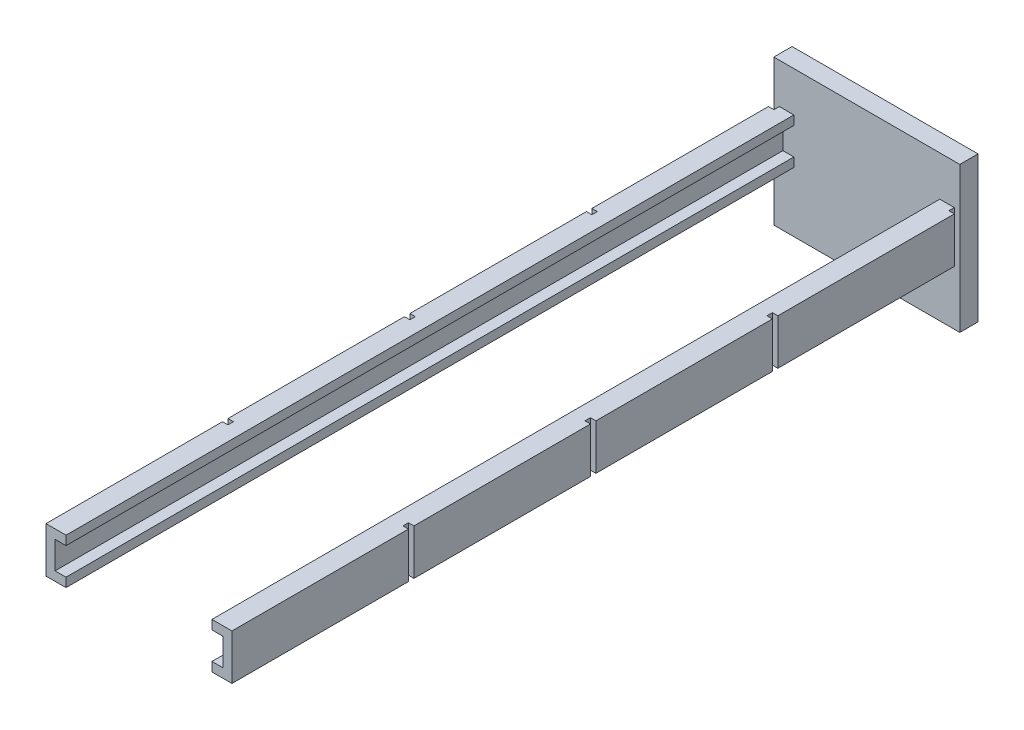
ISO-10303-21;
HEADER;
FILE_DESCRIPTION(('STEP AP214'),'2;1');
FILE_NAME('part.step','',(''),(''),'','','');
FILE_SCHEMA(('AUTOMOTIVE_DESIGN { 1 0 10303 214 1 1 1 1 }'));
ENDSEC;
DATA;
#1=APPLICATION_CONTEXT('core data for automotive mechanical design processes');
#2=APPLICATION_PROTOCOL_DEFINITION('international standard','automotive_design',2000,#1);
#3=PRODUCT_CONTEXT('',#1,'mechanical');
#4=PRODUCT('Part','Part','',(#3));
#5=PRODUCT_RELATED_PRODUCT_CATEGORY('part','',(#4));
#6=PRODUCT_DEFINITION_FORMATION('','',#4);
#7=PRODUCT_DEFINITION_CONTEXT('part definition',#1,'design');
#8=PRODUCT_DEFINITION('design','',#6,#7);
#9=PRODUCT_DEFINITION_SHAPE('','',#8);
#10=(LENGTH_UNIT() NAMED_UNIT(*) SI_UNIT(.MILLI.,.METRE.));
#11=(NAMED_UNIT(*) PLANE_ANGLE_UNIT() SI_UNIT($,.RADIAN.));
#12=(NAMED_UNIT(*) SI_UNIT($,.STERADIAN.) SOLID_ANGLE_UNIT());
#13=UNCERTAINTY_MEASURE_WITH_UNIT(LENGTH_MEASURE(1.E-05),#10,'distance_accuracy_value','');
#14=(GEOMETRIC_REPRESENTATION_CONTEXT(3) GLOBAL_UNCERTAINTY_ASSIGNED_CONTEXT((#13)) GLOBAL_UNIT_ASSIGNED_CONTEXT((#10,
#11,#12)) REPRESENTATION_CONTEXT('',''));
#15=CARTESIAN_POINT('',(0.,0.,0.));
#16=DIRECTION('',(0.,0.,1.));
#17=DIRECTION('',(1.,0.,0.));
#18=AXIS2_PLACEMENT_3D('',#15,#16,#17);
#19=CARTESIAN_POINT('',(-40.1,12.5,400.));
#20=DIRECTION('',(0.,-1.,0.));
#21=DIRECTION('',(1.,0.,0.));
#22=AXIS2_PLACEMENT_3D('',#19,#20,#21);
#23=PLANE('',#22);
#24=DIRECTION('',(-1.,0.,0.));
#25=VECTOR('',#24,1.);
#26=CARTESIAN_POINT('',(-48.1,12.5,300.));
#27=LINE('',#26,#25);
#28=CARTESIAN_POINT('',(-48.1,12.5,300.));
#29=VERTEX_POINT('',#28);
#30=CARTESIAN_POINT('',(-51.1,12.5,300.));
#31=VERTEX_POINT('',#30);
#32=EDGE_CURVE('E365',#29,#31,#27,.T.);
#33=ORIENTED_EDGE('',*,*,#32,.F.);
#34=DIRECTION('',(0.,0.,1.));
#35=VECTOR('',#34,1.);
#36=CARTESIAN_POINT('',(-48.1,12.5,300.));
#37=LINE('',#36,#35);
#38=CARTESIAN_POINT('',(-48.1,12.5,302.991250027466));
#39=VERTEX_POINT('',#38);
#40=EDGE_CURVE('E350',#29,#39,#37,.T.);
#41=ORIENTED_EDGE('',*,*,#40,.T.);
#42=DIRECTION('',(-1.,0.,0.));
#43=VECTOR('',#42,1.);
#44=CARTESIAN_POINT('',(-48.1,12.5,302.991250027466));
#45=LINE('',#44,#43);
#46=CARTESIAN_POINT('',(-51.1,12.5,302.991250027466));
#47=VERTEX_POINT('',#46);
#48=EDGE_CURVE('E348',#39,#47,#45,.T.);
#49=ORIENTED_EDGE('',*,*,#48,.T.);
#50=DIRECTION('',(0.,0.,-1.));
#51=VECTOR('',#50,1.);
#52=CARTESIAN_POINT('',(-51.1,12.5,400.));
#53=LINE('',#52,#51);
#54=CARTESIAN_POINT('',(-51.1,12.5,400.));
#55=VERTEX_POINT('',#54);
#56=EDGE_CURVE('E43',#55,#47,#53,.T.);
#57=ORIENTED_EDGE('',*,*,#56,.F.);
#58=DIRECTION('',(-1.,0.,0.));
#59=VECTOR('',#58,1.);
#60=CARTESIAN_POINT('',(-40.1,12.5,400.));
#61=LINE('',#60,#59);
#62=CARTESIAN_POINT('',(-40.1,12.5,400.));
#63=VERTEX_POINT('',#62);
#64=EDGE_CURVE('E629',#63,#55,#61,.T.);
#65=ORIENTED_EDGE('',*,*,#64,.F.);
#66=DIRECTION('',(0.,0.,-1.));
#67=VECTOR('',#66,1.);
#68=CARTESIAN_POINT('',(-40.1,12.5,400.));
#69=LINE('',#68,#67);
#70=CARTESIAN_POINT('',(-40.1,12.5,0.));
#71=VERTEX_POINT('',#70);
#72=EDGE_CURVE('E11',#63,#71,#69,.T.);
#73=ORIENTED_EDGE('',*,*,#72,.T.);
#74=DIRECTION('',(-1.,0.,0.));
#75=VECTOR('',#74,1.);
#76=CARTESIAN_POINT('',(-40.1,12.5,0.));
#77=LINE('',#76,#75);
#78=CARTESIAN_POINT('',(-48.1,12.5,0.));
#79=VERTEX_POINT('',#78);
#80=EDGE_CURVE('E648',#71,#79,#77,.T.);
#81=ORIENTED_EDGE('',*,*,#80,.T.);
#82=DIRECTION('',(0.,0.,1.));
#83=VECTOR('',#82,1.);
#84=CARTESIAN_POINT('',(-48.1,12.5,0.));
#85=LINE('',#84,#83);
#86=CARTESIAN_POINT('',(-48.1,12.5,2.99125002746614));
#87=VERTEX_POINT('',#86);
#88=EDGE_CURVE('E433',#79,#87,#85,.T.);
#89=ORIENTED_EDGE('',*,*,#88,.T.);
#90=DIRECTION('',(-1.,0.,0.));
#91=VECTOR('',#90,1.);
#92=CARTESIAN_POINT('',(-48.1,12.5,2.99125002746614));
#93=LINE('',#92,#91);
#94=CARTESIAN_POINT('',(-51.1,12.5,2.99125002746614));
#95=VERTEX_POINT('',#94);
#96=EDGE_CURVE('E439',#87,#95,#93,.T.);
#97=ORIENTED_EDGE('',*,*,#96,.T.);
#98=CARTESIAN_POINT('',(-51.1,12.5,100.));
#99=VERTEX_POINT('',#98);
#100=EDGE_CURVE('E667',#99,#95,#53,.T.);
#101=ORIENTED_EDGE('',*,*,#100,.F.);
#102=DIRECTION('',(-1.,0.,0.));
#103=VECTOR('',#102,1.);
#104=CARTESIAN_POINT('',(-48.1,12.5,100.));
#105=LINE('',#104,#103);
#106=CARTESIAN_POINT('',(-48.1,12.5,100.));
#107=VERTEX_POINT('',#106);
#108=EDGE_CURVE('E414',#107,#99,#105,.T.);
#109=ORIENTED_EDGE('',*,*,#108,.F.);
#110=DIRECTION('',(0.,0.,1.));
#111=VECTOR('',#110,1.);
#112=CARTESIAN_POINT('',(-48.1,12.5,100.));
#113=LINE('',#112,#111);
#114=CARTESIAN_POINT('',(-48.1,12.5,102.991250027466));
#115=VERTEX_POINT('',#114);
#116=EDGE_CURVE('E406',#107,#115,#113,.T.);
#117=ORIENTED_EDGE('',*,*,#116,.T.);
#118=DIRECTION('',(-1.,0.,0.));
#119=VECTOR('',#118,1.);
#120=CARTESIAN_POINT('',(-48.1,12.5,102.991250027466));
#121=LINE('',#120,#119);
#122=CARTESIAN_POINT('',(-51.1,12.5,102.991250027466));
#123=VERTEX_POINT('',#122);
#124=EDGE_CURVE('E417',#115,#123,#121,.T.);
#125=ORIENTED_EDGE('',*,*,#124,.T.);
#126=CARTESIAN_POINT('',(-51.1,12.5,200.));
#127=VERTEX_POINT('',#126);
#128=EDGE_CURVE('E671',#127,#123,#53,.T.);
#129=ORIENTED_EDGE('',*,*,#128,.F.);
#130=DIRECTION('',(-1.,0.,0.));
#131=VECTOR('',#130,1.);
#132=CARTESIAN_POINT('',(-48.1,12.5,200.));
#133=LINE('',#132,#131);
#134=CARTESIAN_POINT('',(-48.1,12.5,200.));
#135=VERTEX_POINT('',#134);
#136=EDGE_CURVE('E386',#135,#127,#133,.T.);
#137=ORIENTED_EDGE('',*,*,#136,.F.);
#138=DIRECTION('',(0.,0.,1.));
#139=VECTOR('',#138,1.);
#140=CARTESIAN_POINT('',(-48.1,12.5,200.));
#141=LINE('',#140,#139);
#142=CARTESIAN_POINT('',(-48.1,12.5,202.991250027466));
#143=VERTEX_POINT('',#142);
#144=EDGE_CURVE('E377',#135,#143,#141,.T.);
#145=ORIENTED_EDGE('',*,*,#144,.T.);
#146=DIRECTION('',(-1.,0.,0.));
#147=VECTOR('',#146,1.);
#148=CARTESIAN_POINT('',(-48.1,12.5,202.991250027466));
#149=LINE('',#148,#147);
#150=CARTESIAN_POINT('',(-51.1,12.5,202.991250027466));
#151=VERTEX_POINT('',#150);
#152=EDGE_CURVE('E389',#143,#151,#149,.T.);
#153=ORIENTED_EDGE('',*,*,#152,.T.);
#154=EDGE_CURVE('E37',#31,#151,#53,.T.);
#155=ORIENTED_EDGE('',*,*,#154,.F.);
#156=EDGE_LOOP('',(#33,#41,#49,#57,#65,#73,#81,#89,#97,#101,#109,#117,#125,#129,#137,#145,#153,#155));
#157=FACE_BOUND('',#156,.T.);
#158=ADVANCED_FACE('F33',(#157),#23,.F.);
#159=CARTESIAN_POINT('',(-51.1,12.5,400.));
#160=DIRECTION('',(1.,0.,0.));
#161=DIRECTION('',(0.,0.,-1.));
#162=AXIS2_PLACEMENT_3D('',#159,#160,#161);
#163=PLANE('',#162);
#164=DIRECTION('',(0.,1.,0.));
#165=VECTOR('',#164,1.);
#166=CARTESIAN_POINT('',(-51.1,-12.5,300.));
#167=LINE('',#166,#165);
#168=CARTESIAN_POINT('',(-51.1,-12.5,300.));
#169=VERTEX_POINT('',#168);
#170=EDGE_CURVE('E767',#169,#31,#167,.T.);
#171=ORIENTED_EDGE('',*,*,#170,.T.);
#172=ORIENTED_EDGE('',*,*,#154,.T.);
#173=DIRECTION('',(0.,-1.,0.));
#174=VECTOR('',#173,1.);
#175=CARTESIAN_POINT('',(-51.1,-12.5,202.991250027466));
#176=LINE('',#175,#174);
#177=CARTESIAN_POINT('',(-51.1,-12.5,202.991250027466));
#178=VERTEX_POINT('',#177);
#179=EDGE_CURVE('E372',#151,#178,#176,.T.);
#180=ORIENTED_EDGE('',*,*,#179,.T.);
#181=DIRECTION('',(0.,0.,-1.));
#182=VECTOR('',#181,1.);
#183=CARTESIAN_POINT('',(-51.1,-12.5,400.));
#184=LINE('',#183,#182);
#185=EDGE_CURVE('E674',#169,#178,#184,.T.);
#186=ORIENTED_EDGE('',*,*,#185,.F.);
#187=EDGE_LOOP('',(#171,#172,#180,#186));
#188=FACE_BOUND('',#187,.T.);
#189=ADVANCED_FACE('F739',(#188),#163,.F.);
#190=DIRECTION('',(0.,-1.,0.));
#191=VECTOR('',#190,1.);
#192=CARTESIAN_POINT('',(-51.1,-12.5,302.991250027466));
#193=LINE('',#192,#191);
#194=CARTESIAN_POINT('',(-51.1,-12.5,302.991250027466));
#195=VERTEX_POINT('',#194);
#196=EDGE_CURVE('E764',#47,#195,#193,.T.);
#197=ORIENTED_EDGE('',*,*,#196,.T.);
#198=CARTESIAN_POINT('',(-51.1,-12.5,400.));
#199=VERTEX_POINT('',#198);
#200=EDGE_CURVE('E362',#199,#195,#184,.T.);
#201=ORIENTED_EDGE('',*,*,#200,.F.);
#202=DIRECTION('',(0.,-1.,0.));
#203=VECTOR('',#202,1.);
#204=CARTESIAN_POINT('',(-51.1,12.5,400.));
#205=LINE('',#204,#203);
#206=EDGE_CURVE('E632',#55,#199,#205,.T.);
#207=ORIENTED_EDGE('',*,*,#206,.F.);
#208=ORIENTED_EDGE('',*,*,#56,.T.);
#209=EDGE_LOOP('',(#197,#201,#207,#208));
#210=FACE_BOUND('',#209,.T.);
#211=ADVANCED_FACE('F744',(#210),#163,.F.);
#212=CARTESIAN_POINT('',(-40.1,-12.5,400.));
#213=DIRECTION('',(0.,1.,0.));
#214=DIRECTION('',(-1.,0.,0.));
#215=AXIS2_PLACEMENT_3D('',#212,#213,#214);
#216=PLANE('',#215);
#217=DIRECTION('',(-1.,0.,0.));
#218=VECTOR('',#217,1.);
#219=CARTESIAN_POINT('',(-48.1,-12.5,300.));
#220=LINE('',#219,#218);
#221=CARTESIAN_POINT('',(-48.1,-12.5,300.));
#222=VERTEX_POINT('',#221);
#223=EDGE_CURVE('E363',#222,#169,#220,.T.);
#224=ORIENTED_EDGE('',*,*,#223,.T.);
#225=ORIENTED_EDGE('',*,*,#185,.T.);
#226=DIRECTION('',(-1.,0.,0.));
#227=VECTOR('',#226,1.);
#228=CARTESIAN_POINT('',(-48.1,-12.5,202.991250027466));
#229=LINE('',#228,#227);
#230=CARTESIAN_POINT('',(-48.1,-12.5,202.991250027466));
#231=VERTEX_POINT('',#230);
#232=EDGE_CURVE('E392',#231,#178,#229,.T.);
#233=ORIENTED_EDGE('',*,*,#232,.F.);
#234=DIRECTION('',(0.,0.,-1.));
#235=VECTOR('',#234,1.);
#236=CARTESIAN_POINT('',(-48.1,-12.5,200.));
#237=LINE('',#236,#235);
#238=CARTESIAN_POINT('',(-48.1,-12.5,200.));
#239=VERTEX_POINT('',#238);
#240=EDGE_CURVE('E371',#231,#239,#237,.T.);
#241=ORIENTED_EDGE('',*,*,#240,.T.);
#242=DIRECTION('',(-1.,0.,0.));
#243=VECTOR('',#242,1.);
#244=CARTESIAN_POINT('',(-48.1,-12.5,200.));
#245=LINE('',#244,#243);
#246=CARTESIAN_POINT('',(-51.1,-12.5,200.));
#247=VERTEX_POINT('',#246);
#248=EDGE_CURVE('E380',#239,#247,#245,.T.);
#249=ORIENTED_EDGE('',*,*,#248,.T.);
#250=CARTESIAN_POINT('',(-51.1,-12.5,102.991250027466));
#251=VERTEX_POINT('',#250);
#252=EDGE_CURVE('E672',#247,#251,#184,.T.);
#253=ORIENTED_EDGE('',*,*,#252,.T.);
#254=DIRECTION('',(-1.,0.,0.));
#255=VECTOR('',#254,1.);
#256=CARTESIAN_POINT('',(-48.1,-12.5,102.991250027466));
#257=LINE('',#256,#255);
#258=CARTESIAN_POINT('',(-48.1,-12.5,102.991250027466));
#259=VERTEX_POINT('',#258);
#260=EDGE_CURVE('E420',#259,#251,#257,.T.);
#261=ORIENTED_EDGE('',*,*,#260,.F.);
#262=DIRECTION('',(0.,0.,-1.));
#263=VECTOR('',#262,1.);
#264=CARTESIAN_POINT('',(-48.1,-12.5,100.));
#265=LINE('',#264,#263);
#266=CARTESIAN_POINT('',(-48.1,-12.5,100.));
#267=VERTEX_POINT('',#266);
#268=EDGE_CURVE('E400',#259,#267,#265,.T.);
#269=ORIENTED_EDGE('',*,*,#268,.T.);
#270=DIRECTION('',(-1.,0.,0.));
#271=VECTOR('',#270,1.);
#272=CARTESIAN_POINT('',(-48.1,-12.5,100.));
#273=LINE('',#272,#271);
#274=CARTESIAN_POINT('',(-51.1,-12.5,100.));
#275=VERTEX_POINT('',#274);
#276=EDGE_CURVE('E409',#267,#275,#273,.T.);
#277=ORIENTED_EDGE('',*,*,#276,.T.);
#278=CARTESIAN_POINT('',(-51.1,-12.5,2.99125002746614));
#279=VERTEX_POINT('',#278);
#280=EDGE_CURVE('E680',#275,#279,#184,.T.);
#281=ORIENTED_EDGE('',*,*,#280,.T.);
#282=DIRECTION('',(-1.,0.,0.));
#283=VECTOR('',#282,1.);
#284=CARTESIAN_POINT('',(-48.1,-12.5,2.99125002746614));
#285=LINE('',#284,#283);
#286=CARTESIAN_POINT('',(-48.1,-12.5,2.99125002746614));
#287=VERTEX_POINT('',#286);
#288=EDGE_CURVE('E436',#287,#279,#285,.T.);
#289=ORIENTED_EDGE('',*,*,#288,.F.);
#290=DIRECTION('',(0.,0.,-1.));
#291=VECTOR('',#290,1.);
#292=CARTESIAN_POINT('',(-48.1,-12.5,0.));
#293=LINE('',#292,#291);
#294=CARTESIAN_POINT('',(-48.1,-12.5,0.));
#295=VERTEX_POINT('',#294);
#296=EDGE_CURVE('E428',#287,#295,#293,.T.);
#297=ORIENTED_EDGE('',*,*,#296,.T.);
#298=DIRECTION('',(1.,0.,0.));
#299=VECTOR('',#298,1.);
#300=CARTESIAN_POINT('',(-40.1,-12.5,0.));
#301=LINE('',#300,#299);
#302=CARTESIAN_POINT('',(-40.1,-12.5,0.));
#303=VERTEX_POINT('',#302);
#304=EDGE_CURVE('E656',#295,#303,#301,.T.);
#305=ORIENTED_EDGE('',*,*,#304,.T.);
#306=DIRECTION('',(0.,0.,-1.));
#307=VECTOR('',#306,1.);
#308=CARTESIAN_POINT('',(-40.1,-12.5,400.));
#309=LINE('',#308,#307);
#310=CARTESIAN_POINT('',(-40.1,-12.5,400.));
#311=VERTEX_POINT('',#310);
#312=EDGE_CURVE('E681',#311,#303,#309,.T.);
#313=ORIENTED_EDGE('',*,*,#312,.F.);
#314=DIRECTION('',(1.,0.,0.));
#315=VECTOR('',#314,1.);
#316=CARTESIAN_POINT('',(-40.1,-12.5,400.));
#317=LINE('',#316,#315);
#318=EDGE_CURVE('E634',#199,#311,#317,.T.);
#319=ORIENTED_EDGE('',*,*,#318,.F.);
#320=ORIENTED_EDGE('',*,*,#200,.T.);
#321=DIRECTION('',(-1.,0.,0.));
#322=VECTOR('',#321,1.);
#323=CARTESIAN_POINT('',(-48.1,-12.5,302.991250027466));
#324=LINE('',#323,#322);
#325=CARTESIAN_POINT('',(-48.1,-12.5,302.991250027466));
#326=VERTEX_POINT('',#325);
#327=EDGE_CURVE('E345',#326,#195,#324,.T.);
#328=ORIENTED_EDGE('',*,*,#327,.F.);
#329=DIRECTION('',(0.,0.,-1.));
#330=VECTOR('',#329,1.);
#331=CARTESIAN_POINT('',(-48.1,-12.5,300.));
#332=LINE('',#331,#330);
#333=EDGE_CURVE('E351',#326,#222,#332,.T.);
#334=ORIENTED_EDGE('',*,*,#333,.T.);
#335=EDGE_LOOP('',(#224,#225,#233,#241,#249,#253,#261,#269,#277,#281,#289,#297,#305,#313,#319,
#320,#328,#334));
#336=FACE_BOUND('',#335,.T.);
#337=ADVANCED_FACE('F359',(#336),#216,.F.);
#338=DIRECTION('',(0.,1.,0.));
#339=VECTOR('',#338,1.);
#340=CARTESIAN_POINT('',(-51.1,-12.5,200.));
#341=LINE('',#340,#339);
#342=EDGE_CURVE('E381',#247,#127,#341,.T.);
#343=ORIENTED_EDGE('',*,*,#342,.T.);
#344=ORIENTED_EDGE('',*,*,#128,.T.);
#345=DIRECTION('',(0.,-1.,0.));
#346=VECTOR('',#345,1.);
#347=CARTESIAN_POINT('',(-51.1,-12.5,102.991250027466));
#348=LINE('',#347,#346);
#349=EDGE_CURVE('E401',#123,#251,#348,.T.);
#350=ORIENTED_EDGE('',*,*,#349,.T.);
#351=ORIENTED_EDGE('',*,*,#252,.F.);
#352=EDGE_LOOP('',(#343,#344,#350,#351));
#353=FACE_BOUND('',#352,.T.);
#354=ADVANCED_FACE('F755',(#353),#163,.F.);
#355=DIRECTION('',(0.,1.,0.));
#356=VECTOR('',#355,1.);
#357=CARTESIAN_POINT('',(-51.1,-12.5,100.));
#358=LINE('',#357,#356);
#359=EDGE_CURVE('E388',#275,#99,#358,.T.);
#360=ORIENTED_EDGE('',*,*,#359,.T.);
#361=ORIENTED_EDGE('',*,*,#100,.T.);
#362=DIRECTION('',(0.,-1.,0.));
#363=VECTOR('',#362,1.);
#364=CARTESIAN_POINT('',(-51.1,-12.5,2.99125002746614));
#365=LINE('',#364,#363);
#366=EDGE_CURVE('E416',#95,#279,#365,.T.);
#367=ORIENTED_EDGE('',*,*,#366,.T.);
#368=ORIENTED_EDGE('',*,*,#280,.F.);
#369=EDGE_LOOP('',(#360,#361,#367,#368));
#370=FACE_BOUND('',#369,.T.);
#371=ADVANCED_FACE('F752',(#370),#163,.F.);
#372=DIRECTION('',(0.,1.,0.));
#373=VECTOR('',#372,1.);
#374=CARTESIAN_POINT('',(-51.1,34.5585479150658,0.));
#375=LINE('',#374,#373);
#376=CARTESIAN_POINT('',(-51.1,-45.4414520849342,0.));
#377=VERTEX_POINT('',#376);
#378=CARTESIAN_POINT('',(-51.1,34.5585479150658,0.));
#379=VERTEX_POINT('',#378);
#380=EDGE_CURVE('E617',#377,#379,#375,.T.);
#381=ORIENTED_EDGE('',*,*,#380,.T.);
#382=DIRECTION('',(0.,0.,1.));
#383=VECTOR('',#382,1.);
#384=CARTESIAN_POINT('',(-51.1,34.5585479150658,-10.));
#385=LINE('',#384,#383);
#386=CARTESIAN_POINT('',(-51.1,34.5585479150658,-10.));
#387=VERTEX_POINT('',#386);
#388=EDGE_CURVE('E1352',#387,#379,#385,.T.);
#389=ORIENTED_EDGE('',*,*,#388,.F.);
#390=DIRECTION('',(0.,1.,0.));
#391=VECTOR('',#390,1.);
#392=CARTESIAN_POINT('',(-51.1,34.5585479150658,-10.));
#393=LINE('',#392,#391);
#394=CARTESIAN_POINT('',(-51.1,-45.4414520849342,-10.));
#395=VERTEX_POINT('',#394);
#396=EDGE_CURVE('E609',#395,#387,#393,.T.);
#397=ORIENTED_EDGE('',*,*,#396,.F.);
#398=DIRECTION('',(0.,0.,1.));
#399=VECTOR('',#398,1.);
#400=CARTESIAN_POINT('',(-51.1,-45.4414520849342,-10.));
#401=LINE('',#400,#399);
#402=EDGE_CURVE('E1350',#395,#377,#401,.T.);
#403=ORIENTED_EDGE('',*,*,#402,.T.);
#404=EDGE_LOOP('',(#381,#389,#397,#403));
#405=FACE_BOUND('',#404,.T.);
#406=ADVANCED_FACE('F747',(#405),#163,.F.);
#407=CARTESIAN_POINT('',(51.1,34.5585479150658,-10.));
#408=DIRECTION('',(-1.,0.,0.));
#409=DIRECTION('',(0.,0.,1.));
#410=AXIS2_PLACEMENT_3D('',#407,#408,#409);
#411=PLANE('',#410);
#412=DIRECTION('',(0.,0.,-1.));
#413=VECTOR('',#412,1.);
#414=CARTESIAN_POINT('',(51.1,12.5,400.));
#415=LINE('',#414,#413);
#416=CARTESIAN_POINT('',(51.1,12.5,300.));
#417=VERTEX_POINT('',#416);
#418=CARTESIAN_POINT('',(51.1,12.5,202.991250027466));
#419=VERTEX_POINT('',#418);
#420=EDGE_CURVE('E579',#417,#419,#415,.T.);
#421=ORIENTED_EDGE('',*,*,#420,.F.);
#422=DIRECTION('',(0.,1.,0.));
#423=VECTOR('',#422,1.);
#424=CARTESIAN_POINT('',(51.1,-12.5,300.));
#425=LINE('',#424,#423);
#426=CARTESIAN_POINT('',(51.1,-12.5,300.));
#427=VERTEX_POINT('',#426);
#428=EDGE_CURVE('E442',#427,#417,#425,.T.);
#429=ORIENTED_EDGE('',*,*,#428,.F.);
#430=DIRECTION('',(0.,0.,-1.));
#431=VECTOR('',#430,1.);
#432=CARTESIAN_POINT('',(51.1,-12.5,400.));
#433=LINE('',#432,#431);
#434=CARTESIAN_POINT('',(51.1,-12.5,202.991250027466));
#435=VERTEX_POINT('',#434);
#436=EDGE_CURVE('E584',#427,#435,#433,.T.);
#437=ORIENTED_EDGE('',*,*,#436,.T.);
#438=DIRECTION('',(0.,-1.,0.));
#439=VECTOR('',#438,1.);
#440=CARTESIAN_POINT('',(51.1,-12.5,202.991250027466));
#441=LINE('',#440,#439);
#442=EDGE_CURVE('E474',#419,#435,#441,.T.);
#443=ORIENTED_EDGE('',*,*,#442,.F.);
#444=EDGE_LOOP('',(#421,#429,#437,#443));
#445=FACE_BOUND('',#444,.T.);
#446=ADVANCED_FACE('F751',(#445),#411,.F.);
#447=CARTESIAN_POINT('',(51.1,12.5,200.));
#448=VERTEX_POINT('',#447);
#449=CARTESIAN_POINT('',(51.1,12.5,102.991250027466));
#450=VERTEX_POINT('',#449);
#451=EDGE_CURVE('E1284',#448,#450,#415,.T.);
#452=ORIENTED_EDGE('',*,*,#451,.F.);
#453=DIRECTION('',(0.,1.,0.));
#454=VECTOR('',#453,1.);
#455=CARTESIAN_POINT('',(51.1,-12.5,200.));
#456=LINE('',#455,#454);
#457=CARTESIAN_POINT('',(51.1,-12.5,200.));
#458=VERTEX_POINT('',#457);
#459=EDGE_CURVE('E462',#458,#448,#456,.T.);
#460=ORIENTED_EDGE('',*,*,#459,.F.);
#461=CARTESIAN_POINT('',(51.1,-12.5,102.991250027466));
#462=VERTEX_POINT('',#461);
#463=EDGE_CURVE('E1296',#458,#462,#433,.T.);
#464=ORIENTED_EDGE('',*,*,#463,.T.);
#465=DIRECTION('',(0.,-1.,0.));
#466=VECTOR('',#465,1.);
#467=CARTESIAN_POINT('',(51.1,-12.5,102.991250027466));
#468=LINE('',#467,#466);
#469=EDGE_CURVE('E501',#450,#462,#468,.T.);
#470=ORIENTED_EDGE('',*,*,#469,.F.);
#471=EDGE_LOOP('',(#452,#460,#464,#470));
#472=FACE_BOUND('',#471,.T.);
#473=ADVANCED_FACE('F1168',(#472),#411,.F.);
#474=CARTESIAN_POINT('',(51.1,12.5,100.));
#475=VERTEX_POINT('',#474);
#476=CARTESIAN_POINT('',(51.1,12.5,2.99125002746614));
#477=VERTEX_POINT('',#476);
#478=EDGE_CURVE('E561',#475,#477,#415,.T.);
#479=ORIENTED_EDGE('',*,*,#478,.F.);
#480=DIRECTION('',(0.,1.,0.));
#481=VECTOR('',#480,1.);
#482=CARTESIAN_POINT('',(51.1,-12.5,100.));
#483=LINE('',#482,#481);
#484=CARTESIAN_POINT('',(51.1,-12.5,100.));
#485=VERTEX_POINT('',#484);
#486=EDGE_CURVE('E488',#485,#475,#483,.T.);
#487=ORIENTED_EDGE('',*,*,#486,.F.);
#488=CARTESIAN_POINT('',(51.1,-12.5,2.99125002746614));
#489=VERTEX_POINT('',#488);
#490=EDGE_CURVE('E578',#485,#489,#433,.T.);
#491=ORIENTED_EDGE('',*,*,#490,.T.);
#492=DIRECTION('',(0.,-1.,0.));
#493=VECTOR('',#492,1.);
#494=CARTESIAN_POINT('',(51.1,-12.5,2.99125002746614));
#495=LINE('',#494,#493);
#496=EDGE_CURVE('E515',#477,#489,#495,.T.);
#497=ORIENTED_EDGE('',*,*,#496,.F.);
#498=EDGE_LOOP('',(#479,#487,#491,#497));
#499=FACE_BOUND('',#498,.T.);
#500=ADVANCED_FACE('F818',(#499),#411,.F.);
#501=DIRECTION('',(0.,-1.,0.));
#502=VECTOR('',#501,1.);
#503=CARTESIAN_POINT('',(51.1,34.5585479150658,0.));
#504=LINE('',#503,#502);
#505=CARTESIAN_POINT('',(51.1,34.5585479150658,0.));
#506=VERTEX_POINT('',#505);
#507=CARTESIAN_POINT('',(51.1,-45.4414520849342,0.));
#508=VERTEX_POINT('',#507);
#509=EDGE_CURVE('E602',#506,#508,#504,.T.);
#510=ORIENTED_EDGE('',*,*,#509,.T.);
#511=DIRECTION('',(0.,0.,1.));
#512=VECTOR('',#511,1.);
#513=CARTESIAN_POINT('',(51.1,-45.4414520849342,-10.));
#514=LINE('',#513,#512);
#515=CARTESIAN_POINT('',(51.1,-45.4414520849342,-10.));
#516=VERTEX_POINT('',#515);
#517=EDGE_CURVE('E624',#516,#508,#514,.T.);
#518=ORIENTED_EDGE('',*,*,#517,.F.);
#519=DIRECTION('',(0.,-1.,0.));
#520=VECTOR('',#519,1.);
#521=CARTESIAN_POINT('',(51.1,34.5585479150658,-10.));
#522=LINE('',#521,#520);
#523=CARTESIAN_POINT('',(51.1,34.5585479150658,-10.));
#524=VERTEX_POINT('',#523);
#525=EDGE_CURVE('E603',#524,#516,#522,.T.);
#526=ORIENTED_EDGE('',*,*,#525,.F.);
#527=DIRECTION('',(0.,0.,1.));
#528=VECTOR('',#527,1.);
#529=CARTESIAN_POINT('',(51.1,34.5585479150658,-10.));
#530=LINE('',#529,#528);
#531=EDGE_CURVE('E613',#524,#506,#530,.T.);
#532=ORIENTED_EDGE('',*,*,#531,.T.);
#533=EDGE_LOOP('',(#510,#518,#526,#532));
#534=FACE_BOUND('',#533,.T.);
#535=ADVANCED_FACE('F812',(#534),#411,.F.);
#536=CARTESIAN_POINT('',(0.,0.,0.));
#537=DIRECTION('',(0.,0.,-1.));
#538=DIRECTION('',(-1.,0.,0.));
#539=AXIS2_PLACEMENT_3D('',#536,#537,#538);
#540=PLANE('',#539);
#541=DIRECTION('',(1.,0.,0.));
#542=VECTOR('',#541,1.);
#543=CARTESIAN_POINT('',(51.1,34.5585479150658,0.));
#544=LINE('',#543,#542);
#545=EDGE_CURVE('E607',#379,#506,#544,.T.);
#546=ORIENTED_EDGE('',*,*,#545,.F.);
#547=ORIENTED_EDGE('',*,*,#380,.F.);
#548=DIRECTION('',(-1.,0.,0.));
#549=VECTOR('',#548,1.);
#550=CARTESIAN_POINT('',(51.1,-45.4414520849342,0.));
#551=LINE('',#550,#549);
#552=EDGE_CURVE('E615',#508,#377,#551,.T.);
#553=ORIENTED_EDGE('',*,*,#552,.F.);
#554=ORIENTED_EDGE('',*,*,#509,.F.);
#555=EDGE_LOOP('',(#546,#547,#553,#554));
#556=FACE_BOUND('',#555,.T.);
#557=DIRECTION('',(-1.,0.,0.));
#558=VECTOR('',#557,1.);
#559=CARTESIAN_POINT('',(40.1,12.5,0.));
#560=LINE('',#559,#558);
#561=CARTESIAN_POINT('',(48.1,12.5,0.));
#562=VERTEX_POINT('',#561);
#563=CARTESIAN_POINT('',(40.1,12.5,0.));
#564=VERTEX_POINT('',#563);
#565=EDGE_CURVE('E540',#562,#564,#560,.T.);
#566=ORIENTED_EDGE('',*,*,#565,.F.);
#567=DIRECTION('',(0.,1.,0.));
#568=VECTOR('',#567,1.);
#569=CARTESIAN_POINT('',(48.1,-12.5,0.));
#570=LINE('',#569,#568);
#571=CARTESIAN_POINT('',(48.1,-12.5,0.));
#572=VERTEX_POINT('',#571);
#573=EDGE_CURVE('E524',#572,#562,#570,.T.);
#574=ORIENTED_EDGE('',*,*,#573,.F.);
#575=DIRECTION('',(1.,0.,0.));
#576=VECTOR('',#575,1.);
#577=CARTESIAN_POINT('',(40.1,-12.5,0.));
#578=LINE('',#577,#576);
#579=CARTESIAN_POINT('',(40.1,-12.5,0.));
#580=VERTEX_POINT('',#579);
#581=EDGE_CURVE('E547',#580,#572,#578,.T.);
#582=ORIENTED_EDGE('',*,*,#581,.F.);
#583=DIRECTION('',(0.,-1.,0.));
#584=VECTOR('',#583,1.);
#585=CARTESIAN_POINT('',(40.1,-7.50000000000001,0.));
#586=LINE('',#585,#584);
#587=CARTESIAN_POINT('',(40.1,-7.50000000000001,0.));
#588=VERTEX_POINT('',#587);
#589=EDGE_CURVE('E571',#588,#580,#586,.T.);
#590=ORIENTED_EDGE('',*,*,#589,.F.);
#591=DIRECTION('',(-1.,0.,0.));
#592=VECTOR('',#591,1.);
#593=CARTESIAN_POINT('',(40.1,-7.50000000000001,0.));
#594=LINE('',#593,#592);
#595=CARTESIAN_POINT('',(46.1,-7.50000000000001,0.));
#596=VERTEX_POINT('',#595);
#597=EDGE_CURVE('E569',#596,#588,#594,.T.);
#598=ORIENTED_EDGE('',*,*,#597,.F.);
#599=DIRECTION('',(0.,-1.,0.));
#600=VECTOR('',#599,1.);
#601=CARTESIAN_POINT('',(46.1,-7.50000000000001,0.));
#602=LINE('',#601,#600);
#603=CARTESIAN_POINT('',(46.1,7.49999999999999,0.));
#604=VERTEX_POINT('',#603);
#605=EDGE_CURVE('E567',#604,#596,#602,.T.);
#606=ORIENTED_EDGE('',*,*,#605,.F.);
#607=DIRECTION('',(1.,0.,0.));
#608=VECTOR('',#607,1.);
#609=CARTESIAN_POINT('',(40.1,7.49999999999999,0.));
#610=LINE('',#609,#608);
#611=CARTESIAN_POINT('',(40.1,7.49999999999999,0.));
#612=VERTEX_POINT('',#611);
#613=EDGE_CURVE('E565',#612,#604,#610,.T.);
#614=ORIENTED_EDGE('',*,*,#613,.F.);
#615=DIRECTION('',(0.,-1.,0.));
#616=VECTOR('',#615,1.);
#617=CARTESIAN_POINT('',(40.1,12.5,0.));
#618=LINE('',#617,#616);
#619=EDGE_CURVE('E563',#564,#612,#618,.T.);
#620=ORIENTED_EDGE('',*,*,#619,.F.);
#621=EDGE_LOOP('',(#566,#574,#582,#590,#598,#606,#614,#620));
#622=FACE_BOUND('',#621,.T.);
#623=DIRECTION('',(0.,1.,0.));
#624=VECTOR('',#623,1.);
#625=CARTESIAN_POINT('',(-48.1,-12.5,0.));
#626=LINE('',#625,#624);
#627=EDGE_CURVE('E425',#295,#79,#626,.T.);
#628=ORIENTED_EDGE('',*,*,#627,.T.);
#629=ORIENTED_EDGE('',*,*,#80,.F.);
#630=DIRECTION('',(0.,1.,0.));
#631=VECTOR('',#630,1.);
#632=CARTESIAN_POINT('',(-40.1,12.5,0.));
#633=LINE('',#632,#631);
#634=CARTESIAN_POINT('',(-40.1,7.49999999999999,0.));
#635=VERTEX_POINT('',#634);
#636=EDGE_CURVE('E645',#635,#71,#633,.T.);
#637=ORIENTED_EDGE('',*,*,#636,.F.);
#638=DIRECTION('',(1.,0.,0.));
#639=VECTOR('',#638,1.);
#640=CARTESIAN_POINT('',(-40.1,7.49999999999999,0.));
#641=LINE('',#640,#639);
#642=CARTESIAN_POINT('',(-46.1,7.49999999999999,0.));
#643=VERTEX_POINT('',#642);
#644=EDGE_CURVE('E630',#643,#635,#641,.T.);
#645=ORIENTED_EDGE('',*,*,#644,.F.);
#646=DIRECTION('',(0.,1.,0.));
#647=VECTOR('',#646,1.);
#648=CARTESIAN_POINT('',(-46.1,-7.50000000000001,0.));
#649=LINE('',#648,#647);
#650=CARTESIAN_POINT('',(-46.1,-7.50000000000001,0.));
#651=VERTEX_POINT('',#650);
#652=EDGE_CURVE('E703',#651,#643,#649,.T.);
#653=ORIENTED_EDGE('',*,*,#652,.F.);
#654=DIRECTION('',(-1.,0.,0.));
#655=VECTOR('',#654,1.);
#656=CARTESIAN_POINT('',(-40.1,-7.50000000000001,0.));
#657=LINE('',#656,#655);
#658=CARTESIAN_POINT('',(-40.1,-7.50000000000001,0.));
#659=VERTEX_POINT('',#658);
#660=EDGE_CURVE('E705',#659,#651,#657,.T.);
#661=ORIENTED_EDGE('',*,*,#660,.F.);
#662=DIRECTION('',(0.,1.,0.));
#663=VECTOR('',#662,1.);
#664=CARTESIAN_POINT('',(-40.1,-7.50000000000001,0.));
#665=LINE('',#664,#663);
#666=EDGE_CURVE('E651',#303,#659,#665,.T.);
#667=ORIENTED_EDGE('',*,*,#666,.F.);
#668=ORIENTED_EDGE('',*,*,#304,.F.);
#669=EDGE_LOOP('',(#628,#629,#637,#645,#653,#661,#667,#668));
#670=FACE_BOUND('',#669,.T.);
#671=ADVANCED_FACE('F714',(#556,#622,#670),#540,.F.);
#672=CARTESIAN_POINT('',(-40.1,12.5,400.));
#673=DIRECTION('',(-1.,0.,0.));
#674=DIRECTION('',(0.,0.,1.));
#675=AXIS2_PLACEMENT_3D('',#672,#673,#674);
#676=PLANE('',#675);
#677=ORIENTED_EDGE('',*,*,#636,.T.);
#678=ORIENTED_EDGE('',*,*,#72,.F.);
#679=DIRECTION('',(0.,1.,0.));
#680=VECTOR('',#679,1.);
#681=CARTESIAN_POINT('',(-40.1,12.5,400.));
#682=LINE('',#681,#680);
#683=CARTESIAN_POINT('',(-40.1,7.49999999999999,400.));
#684=VERTEX_POINT('',#683);
#685=EDGE_CURVE('E626',#684,#63,#682,.T.);
#686=ORIENTED_EDGE('',*,*,#685,.F.);
#687=DIRECTION('',(0.,0.,-1.));
#688=VECTOR('',#687,1.);
#689=CARTESIAN_POINT('',(-40.1,7.49999999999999,400.));
#690=LINE('',#689,#688);
#691=EDGE_CURVE('E644',#684,#635,#690,.T.);
#692=ORIENTED_EDGE('',*,*,#691,.T.);
#693=EDGE_LOOP('',(#677,#678,#686,#692));
#694=FACE_BOUND('',#693,.T.);
#695=ADVANCED_FACE('F35',(#694),#676,.F.);
#696=CARTESIAN_POINT('',(-40.1,-7.50000000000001,400.));
#697=DIRECTION('',(-1.,0.,0.));
#698=DIRECTION('',(0.,0.,1.));
#699=AXIS2_PLACEMENT_3D('',#696,#697,#698);
#700=PLANE('',#699);
#701=ORIENTED_EDGE('',*,*,#666,.T.);
#702=DIRECTION('',(0.,0.,-1.));
#703=VECTOR('',#702,1.);
#704=CARTESIAN_POINT('',(-40.1,-7.50000000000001,400.));
#705=LINE('',#704,#703);
#706=CARTESIAN_POINT('',(-40.1,-7.50000000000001,400.));
#707=VERTEX_POINT('',#706);
#708=EDGE_CURVE('E685',#707,#659,#705,.T.);
#709=ORIENTED_EDGE('',*,*,#708,.F.);
#710=DIRECTION('',(0.,1.,0.));
#711=VECTOR('',#710,1.);
#712=CARTESIAN_POINT('',(-40.1,-7.50000000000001,400.));
#713=LINE('',#712,#711);
#714=EDGE_CURVE('E636',#311,#707,#713,.T.);
#715=ORIENTED_EDGE('',*,*,#714,.F.);
#716=ORIENTED_EDGE('',*,*,#312,.T.);
#717=EDGE_LOOP('',(#701,#709,#715,#716));
#718=FACE_BOUND('',#717,.T.);
#719=ADVANCED_FACE('F730',(#718),#700,.F.);
#720=CARTESIAN_POINT('',(-40.1,-7.50000000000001,400.));
#721=DIRECTION('',(0.,-1.,0.));
#722=DIRECTION('',(0.,0.,-1.));
#723=AXIS2_PLACEMENT_3D('',#720,#721,#722);
#724=PLANE('',#723);
#725=ORIENTED_EDGE('',*,*,#660,.T.);
#726=DIRECTION('',(0.,0.,-1.));
#727=VECTOR('',#726,1.);
#728=CARTESIAN_POINT('',(-46.1,-7.50000000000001,400.));
#729=LINE('',#728,#727);
#730=CARTESIAN_POINT('',(-46.1,-7.50000000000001,400.));
#731=VERTEX_POINT('',#730);
#732=EDGE_CURVE('E691',#731,#651,#729,.T.);
#733=ORIENTED_EDGE('',*,*,#732,.F.);
#734=DIRECTION('',(-1.,0.,0.));
#735=VECTOR('',#734,1.);
#736=CARTESIAN_POINT('',(-40.1,-7.50000000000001,400.));
#737=LINE('',#736,#735);
#738=EDGE_CURVE('E638',#707,#731,#737,.T.);
#739=ORIENTED_EDGE('',*,*,#738,.F.);
#740=ORIENTED_EDGE('',*,*,#708,.T.);
#741=EDGE_LOOP('',(#725,#733,#739,#740));
#742=FACE_BOUND('',#741,.T.);
#743=ADVANCED_FACE('F728',(#742),#724,.F.);
#744=CARTESIAN_POINT('',(-46.1,-7.50000000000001,400.));
#745=DIRECTION('',(-1.,0.,0.));
#746=DIRECTION('',(0.,-1.,0.));
#747=AXIS2_PLACEMENT_3D('',#744,#745,#746);
#748=PLANE('',#747);
#749=ORIENTED_EDGE('',*,*,#652,.T.);
#750=DIRECTION('',(0.,0.,-1.));
#751=VECTOR('',#750,1.);
#752=CARTESIAN_POINT('',(-46.1,7.49999999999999,400.));
#753=LINE('',#752,#751);
#754=CARTESIAN_POINT('',(-46.1,7.49999999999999,400.));
#755=VERTEX_POINT('',#754);
#756=EDGE_CURVE('E696',#755,#643,#753,.T.);
#757=ORIENTED_EDGE('',*,*,#756,.F.);
#758=DIRECTION('',(0.,1.,0.));
#759=VECTOR('',#758,1.);
#760=CARTESIAN_POINT('',(-46.1,-7.50000000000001,400.));
#761=LINE('',#760,#759);
#762=EDGE_CURVE('E640',#731,#755,#761,.T.);
#763=ORIENTED_EDGE('',*,*,#762,.F.);
#764=ORIENTED_EDGE('',*,*,#732,.T.);
#765=EDGE_LOOP('',(#749,#757,#763,#764));
#766=FACE_BOUND('',#765,.T.);
#767=ADVANCED_FACE('F717',(#766),#748,.F.);
#768=CARTESIAN_POINT('',(-40.1,7.49999999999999,400.));
#769=DIRECTION('',(0.,1.,0.));
#770=DIRECTION('',(-1.,0.,0.));
#771=AXIS2_PLACEMENT_3D('',#768,#769,#770);
#772=PLANE('',#771);
#773=ORIENTED_EDGE('',*,*,#644,.T.);
#774=ORIENTED_EDGE('',*,*,#691,.F.);
#775=DIRECTION('',(1.,0.,0.));
#776=VECTOR('',#775,1.);
#777=CARTESIAN_POINT('',(-40.1,7.49999999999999,400.));
#778=LINE('',#777,#776);
#779=EDGE_CURVE('E642',#755,#684,#778,.T.);
#780=ORIENTED_EDGE('',*,*,#779,.F.);
#781=ORIENTED_EDGE('',*,*,#756,.T.);
#782=EDGE_LOOP('',(#773,#774,#780,#781));
#783=FACE_BOUND('',#782,.T.);
#784=ADVANCED_FACE('F721',(#783),#772,.F.);
#785=CARTESIAN_POINT('',(0.,0.,400.));
#786=DIRECTION('',(0.,0.,-1.));
#787=DIRECTION('',(-1.,0.,0.));
#788=AXIS2_PLACEMENT_3D('',#785,#786,#787);
#789=PLANE('',#788);
#790=ORIENTED_EDGE('',*,*,#685,.T.);
#791=ORIENTED_EDGE('',*,*,#64,.T.);
#792=ORIENTED_EDGE('',*,*,#206,.T.);
#793=ORIENTED_EDGE('',*,*,#318,.T.);
#794=ORIENTED_EDGE('',*,*,#714,.T.);
#795=ORIENTED_EDGE('',*,*,#738,.T.);
#796=ORIENTED_EDGE('',*,*,#762,.T.);
#797=ORIENTED_EDGE('',*,*,#779,.T.);
#798=EDGE_LOOP('',(#790,#791,#792,#793,#794,#795,#796,#797));
#799=FACE_BOUND('',#798,.T.);
#800=ADVANCED_FACE('F725',(#799),#789,.F.);
#801=CARTESIAN_POINT('',(51.1,-12.5,400.));
#802=VERTEX_POINT('',#801);
#803=CARTESIAN_POINT('',(51.1,-12.5,302.991250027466));
#804=VERTEX_POINT('',#803);
#805=EDGE_CURVE('E580',#802,#804,#433,.T.);
#806=ORIENTED_EDGE('',*,*,#805,.T.);
#807=DIRECTION('',(0.,-1.,0.));
#808=VECTOR('',#807,1.);
#809=CARTESIAN_POINT('',(51.1,-12.5,302.991250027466));
#810=LINE('',#809,#808);
#811=CARTESIAN_POINT('',(51.1,12.5,302.991250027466));
#812=VERTEX_POINT('',#811);
#813=EDGE_CURVE('E449',#812,#804,#810,.T.);
#814=ORIENTED_EDGE('',*,*,#813,.F.);
#815=CARTESIAN_POINT('',(51.1,12.5,400.));
#816=VERTEX_POINT('',#815);
#817=EDGE_CURVE('E575',#816,#812,#415,.T.);
#818=ORIENTED_EDGE('',*,*,#817,.F.);
#819=DIRECTION('',(0.,1.,0.));
#820=VECTOR('',#819,1.);
#821=CARTESIAN_POINT('',(51.1,12.5,400.));
#822=LINE('',#821,#820);
#823=EDGE_CURVE('E559',#802,#816,#822,.T.);
#824=ORIENTED_EDGE('',*,*,#823,.F.);
#825=EDGE_LOOP('',(#806,#814,#818,#824));
#826=FACE_BOUND('',#825,.T.);
#827=ADVANCED_FACE('F821',(#826),#411,.F.);
#828=CARTESIAN_POINT('',(51.1,-45.4414520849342,-10.));
#829=DIRECTION('',(0.,1.,0.));
#830=DIRECTION('',(0.,0.,1.));
#831=AXIS2_PLACEMENT_3D('',#828,#829,#830);
#832=PLANE('',#831);
#833=ORIENTED_EDGE('',*,*,#552,.T.);
#834=ORIENTED_EDGE('',*,*,#402,.F.);
#835=DIRECTION('',(-1.,0.,0.));
#836=VECTOR('',#835,1.);
#837=CARTESIAN_POINT('',(51.1,-45.4414520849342,-10.));
#838=LINE('',#837,#836);
#839=EDGE_CURVE('E606',#516,#395,#838,.T.);
#840=ORIENTED_EDGE('',*,*,#839,.F.);
#841=ORIENTED_EDGE('',*,*,#517,.T.);
#842=EDGE_LOOP('',(#833,#834,#840,#841));
#843=FACE_BOUND('',#842,.T.);
#844=ADVANCED_FACE('F831',(#843),#832,.F.);
#845=CARTESIAN_POINT('',(51.1,34.5585479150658,-10.));
#846=DIRECTION('',(0.,-1.,0.));
#847=DIRECTION('',(0.,0.,-1.));
#848=AXIS2_PLACEMENT_3D('',#845,#846,#847);
#849=PLANE('',#848);
#850=ORIENTED_EDGE('',*,*,#545,.T.);
#851=ORIENTED_EDGE('',*,*,#531,.F.);
#852=DIRECTION('',(1.,0.,0.));
#853=VECTOR('',#852,1.);
#854=CARTESIAN_POINT('',(51.1,34.5585479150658,-10.));
#855=LINE('',#854,#853);
#856=EDGE_CURVE('E611',#387,#524,#855,.T.);
#857=ORIENTED_EDGE('',*,*,#856,.F.);
#858=ORIENTED_EDGE('',*,*,#388,.T.);
#859=EDGE_LOOP('',(#850,#851,#857,#858));
#860=FACE_BOUND('',#859,.T.);
#861=ADVANCED_FACE('F828',(#860),#849,.F.);
#862=CARTESIAN_POINT('',(0.,0.,-10.));
#863=DIRECTION('',(0.,0.,-1.));
#864=DIRECTION('',(-1.,0.,0.));
#865=AXIS2_PLACEMENT_3D('',#862,#863,#864);
#866=PLANE('',#865);
#867=ORIENTED_EDGE('',*,*,#525,.T.);
#868=ORIENTED_EDGE('',*,*,#839,.T.);
#869=ORIENTED_EDGE('',*,*,#396,.T.);
#870=ORIENTED_EDGE('',*,*,#856,.T.);
#871=EDGE_LOOP('',(#867,#868,#869,#870));
#872=FACE_BOUND('',#871,.T.);
#873=ADVANCED_FACE('F826',(#872),#866,.T.);
#874=CARTESIAN_POINT('',(40.1,12.5,400.));
#875=DIRECTION('',(0.,-1.,0.));
#876=DIRECTION('',(1.,0.,0.));
#877=AXIS2_PLACEMENT_3D('',#874,#875,#876);
#878=PLANE('',#877);
#879=DIRECTION('',(0.,0.,1.));
#880=VECTOR('',#879,1.);
#881=CARTESIAN_POINT('',(48.1,12.5,300.));
#882=LINE('',#881,#880);
#883=CARTESIAN_POINT('',(48.1,12.5,300.));
#884=VERTEX_POINT('',#883);
#885=CARTESIAN_POINT('',(48.1,12.5,302.991250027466));
#886=VERTEX_POINT('',#885);
#887=EDGE_CURVE('E448',#884,#886,#882,.T.);
#888=ORIENTED_EDGE('',*,*,#887,.F.);
#889=DIRECTION('',(1.,0.,0.));
#890=VECTOR('',#889,1.);
#891=CARTESIAN_POINT('',(48.1,12.5,300.));
#892=LINE('',#891,#890);
#893=EDGE_CURVE('E457',#884,#417,#892,.T.);
#894=ORIENTED_EDGE('',*,*,#893,.T.);
#895=ORIENTED_EDGE('',*,*,#420,.T.);
#896=DIRECTION('',(1.,0.,0.));
#897=VECTOR('',#896,1.);
#898=CARTESIAN_POINT('',(48.1,12.5,202.991250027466));
#899=LINE('',#898,#897);
#900=CARTESIAN_POINT('',(48.1,12.5,202.991250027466));
#901=VERTEX_POINT('',#900);
#902=EDGE_CURVE('E492',#901,#419,#899,.T.);
#903=ORIENTED_EDGE('',*,*,#902,.F.);
#904=DIRECTION('',(0.,0.,1.));
#905=VECTOR('',#904,1.);
#906=CARTESIAN_POINT('',(48.1,12.5,200.));
#907=LINE('',#906,#905);
#908=CARTESIAN_POINT('',(48.1,12.5,200.));
#909=VERTEX_POINT('',#908);
#910=EDGE_CURVE('E473',#909,#901,#907,.T.);
#911=ORIENTED_EDGE('',*,*,#910,.F.);
#912=DIRECTION('',(1.,0.,0.));
#913=VECTOR('',#912,1.);
#914=CARTESIAN_POINT('',(48.1,12.5,200.));
#915=LINE('',#914,#913);
#916=EDGE_CURVE('E482',#909,#448,#915,.T.);
#917=ORIENTED_EDGE('',*,*,#916,.T.);
#918=ORIENTED_EDGE('',*,*,#451,.T.);
#919=DIRECTION('',(1.,0.,0.));
#920=VECTOR('',#919,1.);
#921=CARTESIAN_POINT('',(48.1,12.5,102.991250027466));
#922=LINE('',#921,#920);
#923=CARTESIAN_POINT('',(48.1,12.5,102.991250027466));
#924=VERTEX_POINT('',#923);
#925=EDGE_CURVE('E519',#924,#450,#922,.T.);
#926=ORIENTED_EDGE('',*,*,#925,.F.);
#927=DIRECTION('',(0.,0.,1.));
#928=VECTOR('',#927,1.);
#929=CARTESIAN_POINT('',(48.1,12.5,100.));
#930=LINE('',#929,#928);
#931=CARTESIAN_POINT('',(48.1,12.5,100.));
#932=VERTEX_POINT('',#931);
#933=EDGE_CURVE('E500',#932,#924,#930,.T.);
#934=ORIENTED_EDGE('',*,*,#933,.F.);
#935=DIRECTION('',(1.,0.,0.));
#936=VECTOR('',#935,1.);
#937=CARTESIAN_POINT('',(48.1,12.5,100.));
#938=LINE('',#937,#936);
#939=EDGE_CURVE('E509',#932,#475,#938,.T.);
#940=ORIENTED_EDGE('',*,*,#939,.T.);
#941=ORIENTED_EDGE('',*,*,#478,.T.);
#942=DIRECTION('',(1.,0.,0.));
#943=VECTOR('',#942,1.);
#944=CARTESIAN_POINT('',(48.1,12.5,2.99125002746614));
#945=LINE('',#944,#943);
#946=CARTESIAN_POINT('',(48.1,12.5,2.99125002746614));
#947=VERTEX_POINT('',#946);
#948=EDGE_CURVE('E534',#947,#477,#945,.T.);
#949=ORIENTED_EDGE('',*,*,#948,.F.);
#950=DIRECTION('',(0.,0.,1.));
#951=VECTOR('',#950,1.);
#952=CARTESIAN_POINT('',(48.1,12.5,0.));
#953=LINE('',#952,#951);
#954=EDGE_CURVE('E526',#562,#947,#953,.T.);
#955=ORIENTED_EDGE('',*,*,#954,.F.);
#956=ORIENTED_EDGE('',*,*,#565,.T.);
#957=DIRECTION('',(0.,0.,-1.));
#958=VECTOR('',#957,1.);
#959=CARTESIAN_POINT('',(40.1,12.5,400.));
#960=LINE('',#959,#958);
#961=CARTESIAN_POINT('',(40.1,12.5,400.));
#962=VERTEX_POINT('',#961);
#963=EDGE_CURVE('E599',#962,#564,#960,.T.);
#964=ORIENTED_EDGE('',*,*,#963,.F.);
#965=DIRECTION('',(-1.,0.,0.));
#966=VECTOR('',#965,1.);
#967=CARTESIAN_POINT('',(40.1,12.5,400.));
#968=LINE('',#967,#966);
#969=EDGE_CURVE('E543',#816,#962,#968,.T.);
#970=ORIENTED_EDGE('',*,*,#969,.F.);
#971=ORIENTED_EDGE('',*,*,#817,.T.);
#972=DIRECTION('',(1.,0.,0.));
#973=VECTOR('',#972,1.);
#974=CARTESIAN_POINT('',(48.1,12.5,302.991250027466));
#975=LINE('',#974,#973);
#976=EDGE_CURVE('E466',#886,#812,#975,.T.);
#977=ORIENTED_EDGE('',*,*,#976,.F.);
#978=EDGE_LOOP('',(#888,#894,#895,#903,#911,#917,#918,#926,#934,#940,#941,#949,#955,#956,#964,
#970,#971,#977));
#979=FACE_BOUND('',#978,.T.);
#980=ADVANCED_FACE('F869',(#979),#878,.F.);
#981=CARTESIAN_POINT('',(40.1,12.5,400.));
#982=DIRECTION('',(1.,0.,0.));
#983=DIRECTION('',(0.,0.,-1.));
#984=AXIS2_PLACEMENT_3D('',#981,#982,#983);
#985=PLANE('',#984);
#986=ORIENTED_EDGE('',*,*,#619,.T.);
#987=DIRECTION('',(0.,0.,-1.));
#988=VECTOR('',#987,1.);
#989=CARTESIAN_POINT('',(40.1,7.49999999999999,400.));
#990=LINE('',#989,#988);
#991=CARTESIAN_POINT('',(40.1,7.49999999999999,400.));
#992=VERTEX_POINT('',#991);
#993=EDGE_CURVE('E596',#992,#612,#990,.T.);
#994=ORIENTED_EDGE('',*,*,#993,.F.);
#995=DIRECTION('',(0.,-1.,0.));
#996=VECTOR('',#995,1.);
#997=CARTESIAN_POINT('',(40.1,12.5,400.));
#998=LINE('',#997,#996);
#999=EDGE_CURVE('E546',#962,#992,#998,.T.);
#1000=ORIENTED_EDGE('',*,*,#999,.F.);
#1001=ORIENTED_EDGE('',*,*,#963,.T.);
#1002=EDGE_LOOP('',(#986,#994,#1000,#1001));
#1003=FACE_BOUND('',#1002,.T.);
#1004=ADVANCED_FACE('F876',(#1003),#985,.F.);
#1005=CARTESIAN_POINT('',(40.1,7.49999999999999,400.));
#1006=DIRECTION('',(0.,1.,0.));
#1007=DIRECTION('',(-1.,0.,0.));
#1008=AXIS2_PLACEMENT_3D('',#1005,#1006,#1007);
#1009=PLANE('',#1008);
#1010=ORIENTED_EDGE('',*,*,#613,.T.);
#1011=DIRECTION('',(0.,0.,-1.));
#1012=VECTOR('',#1011,1.);
#1013=CARTESIAN_POINT('',(46.1,7.49999999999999,400.));
#1014=LINE('',#1013,#1012);
#1015=CARTESIAN_POINT('',(46.1,7.49999999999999,400.));
#1016=VERTEX_POINT('',#1015);
#1017=EDGE_CURVE('E593',#1016,#604,#1014,.T.);
#1018=ORIENTED_EDGE('',*,*,#1017,.F.);
#1019=DIRECTION('',(1.,0.,0.));
#1020=VECTOR('',#1019,1.);
#1021=CARTESIAN_POINT('',(40.1,7.49999999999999,400.));
#1022=LINE('',#1021,#1020);
#1023=EDGE_CURVE('E549',#992,#1016,#1022,.T.);
#1024=ORIENTED_EDGE('',*,*,#1023,.F.);
#1025=ORIENTED_EDGE('',*,*,#993,.T.);
#1026=EDGE_LOOP('',(#1010,#1018,#1024,#1025));
#1027=FACE_BOUND('',#1026,.T.);
#1028=ADVANCED_FACE('F883',(#1027),#1009,.F.);
#1029=CARTESIAN_POINT('',(46.1,-7.50000000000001,400.));
#1030=DIRECTION('',(1.,0.,0.));
#1031=DIRECTION('',(0.,1.,0.));
#1032=AXIS2_PLACEMENT_3D('',#1029,#1030,#1031);
#1033=PLANE('',#1032);
#1034=ORIENTED_EDGE('',*,*,#605,.T.);
#1035=DIRECTION('',(0.,0.,-1.));
#1036=VECTOR('',#1035,1.);
#1037=CARTESIAN_POINT('',(46.1,-7.50000000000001,400.));
#1038=LINE('',#1037,#1036);
#1039=CARTESIAN_POINT('',(46.1,-7.50000000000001,400.));
#1040=VERTEX_POINT('',#1039);
#1041=EDGE_CURVE('E590',#1040,#596,#1038,.T.);
#1042=ORIENTED_EDGE('',*,*,#1041,.F.);
#1043=DIRECTION('',(0.,-1.,0.));
#1044=VECTOR('',#1043,1.);
#1045=CARTESIAN_POINT('',(46.1,-7.50000000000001,400.));
#1046=LINE('',#1045,#1044);
#1047=EDGE_CURVE('E551',#1016,#1040,#1046,.T.);
#1048=ORIENTED_EDGE('',*,*,#1047,.F.);
#1049=ORIENTED_EDGE('',*,*,#1017,.T.);
#1050=EDGE_LOOP('',(#1034,#1042,#1048,#1049));
#1051=FACE_BOUND('',#1050,.T.);
#1052=ADVANCED_FACE('F891',(#1051),#1033,.F.);
#1053=CARTESIAN_POINT('',(40.1,-7.50000000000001,400.));
#1054=DIRECTION('',(0.,-1.,0.));
#1055=DIRECTION('',(0.,0.,-1.));
#1056=AXIS2_PLACEMENT_3D('',#1053,#1054,#1055);
#1057=PLANE('',#1056);
#1058=ORIENTED_EDGE('',*,*,#597,.T.);
#1059=DIRECTION('',(0.,0.,-1.));
#1060=VECTOR('',#1059,1.);
#1061=CARTESIAN_POINT('',(40.1,-7.50000000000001,400.));
#1062=LINE('',#1061,#1060);
#1063=CARTESIAN_POINT('',(40.1,-7.50000000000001,400.));
#1064=VERTEX_POINT('',#1063);
#1065=EDGE_CURVE('E587',#1064,#588,#1062,.T.);
#1066=ORIENTED_EDGE('',*,*,#1065,.F.);
#1067=DIRECTION('',(-1.,0.,0.));
#1068=VECTOR('',#1067,1.);
#1069=CARTESIAN_POINT('',(40.1,-7.50000000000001,400.));
#1070=LINE('',#1069,#1068);
#1071=EDGE_CURVE('E553',#1040,#1064,#1070,.T.);
#1072=ORIENTED_EDGE('',*,*,#1071,.F.);
#1073=ORIENTED_EDGE('',*,*,#1041,.T.);
#1074=EDGE_LOOP('',(#1058,#1066,#1072,#1073));
#1075=FACE_BOUND('',#1074,.T.);
#1076=ADVANCED_FACE('F899',(#1075),#1057,.F.);
#1077=CARTESIAN_POINT('',(40.1,-7.50000000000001,400.));
#1078=DIRECTION('',(1.,0.,0.));
#1079=DIRECTION('',(0.,0.,-1.));
#1080=AXIS2_PLACEMENT_3D('',#1077,#1078,#1079);
#1081=PLANE('',#1080);
#1082=ORIENTED_EDGE('',*,*,#589,.T.);
#1083=DIRECTION('',(0.,0.,-1.));
#1084=VECTOR('',#1083,1.);
#1085=CARTESIAN_POINT('',(40.1,-12.5,400.));
#1086=LINE('',#1085,#1084);
#1087=CARTESIAN_POINT('',(40.1,-12.5,400.));
#1088=VERTEX_POINT('',#1087);
#1089=EDGE_CURVE('E583',#1088,#580,#1086,.T.);
#1090=ORIENTED_EDGE('',*,*,#1089,.F.);
#1091=DIRECTION('',(0.,-1.,0.));
#1092=VECTOR('',#1091,1.);
#1093=CARTESIAN_POINT('',(40.1,-7.50000000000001,400.));
#1094=LINE('',#1093,#1092);
#1095=EDGE_CURVE('E555',#1064,#1088,#1094,.T.);
#1096=ORIENTED_EDGE('',*,*,#1095,.F.);
#1097=ORIENTED_EDGE('',*,*,#1065,.T.);
#1098=EDGE_LOOP('',(#1082,#1090,#1096,#1097));
#1099=FACE_BOUND('',#1098,.T.);
#1100=ADVANCED_FACE('F907',(#1099),#1081,.F.);
#1101=CARTESIAN_POINT('',(40.1,-12.5,400.));
#1102=DIRECTION('',(0.,1.,0.));
#1103=DIRECTION('',(-1.,0.,0.));
#1104=AXIS2_PLACEMENT_3D('',#1101,#1102,#1103);
#1105=PLANE('',#1104);
#1106=ORIENTED_EDGE('',*,*,#436,.F.);
#1107=DIRECTION('',(1.,0.,0.));
#1108=VECTOR('',#1107,1.);
#1109=CARTESIAN_POINT('',(48.1,-12.5,300.));
#1110=LINE('',#1109,#1108);
#1111=CARTESIAN_POINT('',(48.1,-12.5,300.));
#1112=VERTEX_POINT('',#1111);
#1113=EDGE_CURVE('E460',#1112,#427,#1110,.T.);
#1114=ORIENTED_EDGE('',*,*,#1113,.F.);
#1115=DIRECTION('',(0.,0.,-1.));
#1116=VECTOR('',#1115,1.);
#1117=CARTESIAN_POINT('',(48.1,-12.5,300.));
#1118=LINE('',#1117,#1116);
#1119=CARTESIAN_POINT('',(48.1,-12.5,302.991250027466));
#1120=VERTEX_POINT('',#1119);
#1121=EDGE_CURVE('E454',#1120,#1112,#1118,.T.);
#1122=ORIENTED_EDGE('',*,*,#1121,.F.);
#1123=DIRECTION('',(1.,0.,0.));
#1124=VECTOR('',#1123,1.);
#1125=CARTESIAN_POINT('',(48.1,-12.5,302.991250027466));
#1126=LINE('',#1125,#1124);
#1127=EDGE_CURVE('E463',#1120,#804,#1126,.T.);
#1128=ORIENTED_EDGE('',*,*,#1127,.T.);
#1129=ORIENTED_EDGE('',*,*,#805,.F.);
#1130=DIRECTION('',(1.,0.,0.));
#1131=VECTOR('',#1130,1.);
#1132=CARTESIAN_POINT('',(40.1,-12.5,400.));
#1133=LINE('',#1132,#1131);
#1134=EDGE_CURVE('E557',#1088,#802,#1133,.T.);
#1135=ORIENTED_EDGE('',*,*,#1134,.F.);
#1136=ORIENTED_EDGE('',*,*,#1089,.T.);
#1137=ORIENTED_EDGE('',*,*,#581,.T.);
#1138=DIRECTION('',(0.,0.,-1.));
#1139=VECTOR('',#1138,1.);
#1140=CARTESIAN_POINT('',(48.1,-12.5,0.));
#1141=LINE('',#1140,#1139);
#1142=CARTESIAN_POINT('',(48.1,-12.5,2.99125002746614));
#1143=VERTEX_POINT('',#1142);
#1144=EDGE_CURVE('E531',#1143,#572,#1141,.T.);
#1145=ORIENTED_EDGE('',*,*,#1144,.F.);
#1146=DIRECTION('',(1.,0.,0.));
#1147=VECTOR('',#1146,1.);
#1148=CARTESIAN_POINT('',(48.1,-12.5,2.99125002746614));
#1149=LINE('',#1148,#1147);
#1150=EDGE_CURVE('E537',#1143,#489,#1149,.T.);
#1151=ORIENTED_EDGE('',*,*,#1150,.T.);
#1152=ORIENTED_EDGE('',*,*,#490,.F.);
#1153=DIRECTION('',(1.,0.,0.));
#1154=VECTOR('',#1153,1.);
#1155=CARTESIAN_POINT('',(48.1,-12.5,100.));
#1156=LINE('',#1155,#1154);
#1157=CARTESIAN_POINT('',(48.1,-12.5,100.));
#1158=VERTEX_POINT('',#1157);
#1159=EDGE_CURVE('E513',#1158,#485,#1156,.T.);
#1160=ORIENTED_EDGE('',*,*,#1159,.F.);
#1161=DIRECTION('',(0.,0.,-1.));
#1162=VECTOR('',#1161,1.);
#1163=CARTESIAN_POINT('',(48.1,-12.5,100.));
#1164=LINE('',#1163,#1162);
#1165=CARTESIAN_POINT('',(48.1,-12.5,102.991250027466));
#1166=VERTEX_POINT('',#1165);
#1167=EDGE_CURVE('E506',#1166,#1158,#1164,.T.);
#1168=ORIENTED_EDGE('',*,*,#1167,.F.);
#1169=DIRECTION('',(1.,0.,0.));
#1170=VECTOR('',#1169,1.);
#1171=CARTESIAN_POINT('',(48.1,-12.5,102.991250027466));
#1172=LINE('',#1171,#1170);
#1173=EDGE_CURVE('E516',#1166,#462,#1172,.T.);
#1174=ORIENTED_EDGE('',*,*,#1173,.T.);
#1175=ORIENTED_EDGE('',*,*,#463,.F.);
#1176=DIRECTION('',(1.,0.,0.));
#1177=VECTOR('',#1176,1.);
#1178=CARTESIAN_POINT('',(48.1,-12.5,200.));
#1179=LINE('',#1178,#1177);
#1180=CARTESIAN_POINT('',(48.1,-12.5,200.));
#1181=VERTEX_POINT('',#1180);
#1182=EDGE_CURVE('E486',#1181,#458,#1179,.T.);
#1183=ORIENTED_EDGE('',*,*,#1182,.F.);
#1184=DIRECTION('',(0.,0.,-1.));
#1185=VECTOR('',#1184,1.);
#1186=CARTESIAN_POINT('',(48.1,-12.5,200.));
#1187=LINE('',#1186,#1185);
#1188=CARTESIAN_POINT('',(48.1,-12.5,202.991250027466));
#1189=VERTEX_POINT('',#1188);
#1190=EDGE_CURVE('E479',#1189,#1181,#1187,.T.);
#1191=ORIENTED_EDGE('',*,*,#1190,.F.);
#1192=DIRECTION('',(1.,0.,0.));
#1193=VECTOR('',#1192,1.);
#1194=CARTESIAN_POINT('',(48.1,-12.5,202.991250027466));
#1195=LINE('',#1194,#1193);
#1196=EDGE_CURVE('E489',#1189,#435,#1195,.T.);
#1197=ORIENTED_EDGE('',*,*,#1196,.T.);
#1198=EDGE_LOOP('',(#1106,#1114,#1122,#1128,#1129,#1135,#1136,#1137,#1145,#1151,#1152,#1160,
#1168,#1174,#1175,#1183,#1191,#1197));
#1199=FACE_BOUND('',#1198,.T.);
#1200=ADVANCED_FACE('F915',(#1199),#1105,.F.);
#1201=CARTESIAN_POINT('',(0.,0.,400.));
#1202=DIRECTION('',(0.,0.,-1.));
#1203=DIRECTION('',(-1.,0.,0.));
#1204=AXIS2_PLACEMENT_3D('',#1201,#1202,#1203);
#1205=PLANE('',#1204);
#1206=ORIENTED_EDGE('',*,*,#969,.T.);
#1207=ORIENTED_EDGE('',*,*,#999,.T.);
#1208=ORIENTED_EDGE('',*,*,#1023,.T.);
#1209=ORIENTED_EDGE('',*,*,#1047,.T.);
#1210=ORIENTED_EDGE('',*,*,#1071,.T.);
#1211=ORIENTED_EDGE('',*,*,#1095,.T.);
#1212=ORIENTED_EDGE('',*,*,#1134,.T.);
#1213=ORIENTED_EDGE('',*,*,#823,.T.);
#1214=EDGE_LOOP('',(#1206,#1207,#1208,#1209,#1210,#1211,#1212,#1213));
#1215=FACE_BOUND('',#1214,.T.);
#1216=ADVANCED_FACE('F923',(#1215),#1205,.F.);
#1217=CARTESIAN_POINT('',(48.1,-12.5,2.99125002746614));
#1218=DIRECTION('',(0.,0.,1.));
#1219=DIRECTION('',(1.,0.,0.));
#1220=AXIS2_PLACEMENT_3D('',#1217,#1218,#1219);
#1221=PLANE('',#1220);
#1222=ORIENTED_EDGE('',*,*,#496,.T.);
#1223=ORIENTED_EDGE('',*,*,#1150,.F.);
#1224=DIRECTION('',(0.,-1.,0.));
#1225=VECTOR('',#1224,1.);
#1226=CARTESIAN_POINT('',(48.1,-12.5,2.99125002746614));
#1227=LINE('',#1226,#1225);
#1228=EDGE_CURVE('E529',#947,#1143,#1227,.T.);
#1229=ORIENTED_EDGE('',*,*,#1228,.F.);
#1230=ORIENTED_EDGE('',*,*,#948,.T.);
#1231=EDGE_LOOP('',(#1222,#1223,#1229,#1230));
#1232=FACE_BOUND('',#1231,.T.);
#1233=ADVANCED_FACE('F931',(#1232),#1221,.F.);
#1234=CARTESIAN_POINT('',(48.1,0.,0.));
#1235=DIRECTION('',(1.,0.,0.));
#1236=DIRECTION('',(0.,0.,-1.));
#1237=AXIS2_PLACEMENT_3D('',#1234,#1235,#1236);
#1238=PLANE('',#1237);
#1239=ORIENTED_EDGE('',*,*,#573,.T.);
#1240=ORIENTED_EDGE('',*,*,#954,.T.);
#1241=ORIENTED_EDGE('',*,*,#1228,.T.);
#1242=ORIENTED_EDGE('',*,*,#1144,.T.);
#1243=EDGE_LOOP('',(#1239,#1240,#1241,#1242));
#1244=FACE_BOUND('',#1243,.T.);
#1245=ADVANCED_FACE('F940',(#1244),#1238,.T.);
#1246=CARTESIAN_POINT('',(48.1,-12.5,100.));
#1247=DIRECTION('',(0.,0.,-1.));
#1248=DIRECTION('',(-1.,0.,0.));
#1249=AXIS2_PLACEMENT_3D('',#1246,#1247,#1248);
#1250=PLANE('',#1249);
#1251=ORIENTED_EDGE('',*,*,#486,.T.);
#1252=ORIENTED_EDGE('',*,*,#939,.F.);
#1253=DIRECTION('',(0.,1.,0.));
#1254=VECTOR('',#1253,1.);
#1255=CARTESIAN_POINT('',(48.1,-12.5,100.));
#1256=LINE('',#1255,#1254);
#1257=EDGE_CURVE('E497',#1158,#932,#1256,.T.);
#1258=ORIENTED_EDGE('',*,*,#1257,.F.);
#1259=ORIENTED_EDGE('',*,*,#1159,.T.);
#1260=EDGE_LOOP('',(#1251,#1252,#1258,#1259));
#1261=FACE_BOUND('',#1260,.T.);
#1262=ADVANCED_FACE('F948',(#1261),#1250,.F.);
#1263=CARTESIAN_POINT('',(48.1,-12.5,102.991250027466));
#1264=DIRECTION('',(0.,0.,1.));
#1265=DIRECTION('',(1.,0.,0.));
#1266=AXIS2_PLACEMENT_3D('',#1263,#1264,#1265);
#1267=PLANE('',#1266);
#1268=ORIENTED_EDGE('',*,*,#469,.T.);
#1269=ORIENTED_EDGE('',*,*,#1173,.F.);
#1270=DIRECTION('',(0.,-1.,0.));
#1271=VECTOR('',#1270,1.);
#1272=CARTESIAN_POINT('',(48.1,-12.5,102.991250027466));
#1273=LINE('',#1272,#1271);
#1274=EDGE_CURVE('E504',#924,#1166,#1273,.T.);
#1275=ORIENTED_EDGE('',*,*,#1274,.F.);
#1276=ORIENTED_EDGE('',*,*,#925,.T.);
#1277=EDGE_LOOP('',(#1268,#1269,#1275,#1276));
#1278=FACE_BOUND('',#1277,.T.);
#1279=ADVANCED_FACE('F956',(#1278),#1267,.F.);
#1280=CARTESIAN_POINT('',(48.1,0.,100.));
#1281=DIRECTION('',(1.,0.,0.));
#1282=DIRECTION('',(0.,0.,-1.));
#1283=AXIS2_PLACEMENT_3D('',#1280,#1281,#1282);
#1284=PLANE('',#1283);
#1285=ORIENTED_EDGE('',*,*,#1257,.T.);
#1286=ORIENTED_EDGE('',*,*,#933,.T.);
#1287=ORIENTED_EDGE('',*,*,#1274,.T.);
#1288=ORIENTED_EDGE('',*,*,#1167,.T.);
#1289=EDGE_LOOP('',(#1285,#1286,#1287,#1288));
#1290=FACE_BOUND('',#1289,.T.);
#1291=ADVANCED_FACE('F964',(#1290),#1284,.T.);
#1292=CARTESIAN_POINT('',(48.1,-12.5,200.));
#1293=DIRECTION('',(0.,0.,-1.));
#1294=DIRECTION('',(-1.,0.,0.));
#1295=AXIS2_PLACEMENT_3D('',#1292,#1293,#1294);
#1296=PLANE('',#1295);
#1297=ORIENTED_EDGE('',*,*,#459,.T.);
#1298=ORIENTED_EDGE('',*,*,#916,.F.);
#1299=DIRECTION('',(0.,1.,0.));
#1300=VECTOR('',#1299,1.);
#1301=CARTESIAN_POINT('',(48.1,-12.5,200.));
#1302=LINE('',#1301,#1300);
#1303=EDGE_CURVE('E470',#1181,#909,#1302,.T.);
#1304=ORIENTED_EDGE('',*,*,#1303,.F.);
#1305=ORIENTED_EDGE('',*,*,#1182,.T.);
#1306=EDGE_LOOP('',(#1297,#1298,#1304,#1305));
#1307=FACE_BOUND('',#1306,.T.);
#1308=ADVANCED_FACE('F972',(#1307),#1296,.F.);
#1309=CARTESIAN_POINT('',(48.1,-12.5,202.991250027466));
#1310=DIRECTION('',(0.,0.,1.));
#1311=DIRECTION('',(1.,0.,0.));
#1312=AXIS2_PLACEMENT_3D('',#1309,#1310,#1311);
#1313=PLANE('',#1312);
#1314=ORIENTED_EDGE('',*,*,#442,.T.);
#1315=ORIENTED_EDGE('',*,*,#1196,.F.);
#1316=DIRECTION('',(0.,-1.,0.));
#1317=VECTOR('',#1316,1.);
#1318=CARTESIAN_POINT('',(48.1,-12.5,202.991250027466));
#1319=LINE('',#1318,#1317);
#1320=EDGE_CURVE('E477',#901,#1189,#1319,.T.);
#1321=ORIENTED_EDGE('',*,*,#1320,.F.);
#1322=ORIENTED_EDGE('',*,*,#902,.T.);
#1323=EDGE_LOOP('',(#1314,#1315,#1321,#1322));
#1324=FACE_BOUND('',#1323,.T.);
#1325=ADVANCED_FACE('F980',(#1324),#1313,.F.);
#1326=CARTESIAN_POINT('',(48.1,0.,200.));
#1327=DIRECTION('',(1.,0.,0.));
#1328=DIRECTION('',(0.,0.,-1.));
#1329=AXIS2_PLACEMENT_3D('',#1326,#1327,#1328);
#1330=PLANE('',#1329);
#1331=ORIENTED_EDGE('',*,*,#1303,.T.);
#1332=ORIENTED_EDGE('',*,*,#910,.T.);
#1333=ORIENTED_EDGE('',*,*,#1320,.T.);
#1334=ORIENTED_EDGE('',*,*,#1190,.T.);
#1335=EDGE_LOOP('',(#1331,#1332,#1333,#1334));
#1336=FACE_BOUND('',#1335,.T.);
#1337=ADVANCED_FACE('F988',(#1336),#1330,.T.);
#1338=CARTESIAN_POINT('',(48.1,-12.5,300.));
#1339=DIRECTION('',(0.,0.,-1.));
#1340=DIRECTION('',(-1.,0.,0.));
#1341=AXIS2_PLACEMENT_3D('',#1338,#1339,#1340);
#1342=PLANE('',#1341);
#1343=ORIENTED_EDGE('',*,*,#428,.T.);
#1344=ORIENTED_EDGE('',*,*,#893,.F.);
#1345=DIRECTION('',(0.,1.,0.));
#1346=VECTOR('',#1345,1.);
#1347=CARTESIAN_POINT('',(48.1,-12.5,300.));
#1348=LINE('',#1347,#1346);
#1349=EDGE_CURVE('E445',#1112,#884,#1348,.T.);
#1350=ORIENTED_EDGE('',*,*,#1349,.F.);
#1351=ORIENTED_EDGE('',*,*,#1113,.T.);
#1352=EDGE_LOOP('',(#1343,#1344,#1350,#1351));
#1353=FACE_BOUND('',#1352,.T.);
#1354=ADVANCED_FACE('F996',(#1353),#1342,.F.);
#1355=CARTESIAN_POINT('',(48.1,-12.5,302.991250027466));
#1356=DIRECTION('',(0.,0.,1.));
#1357=DIRECTION('',(1.,0.,0.));
#1358=AXIS2_PLACEMENT_3D('',#1355,#1356,#1357);
#1359=PLANE('',#1358);
#1360=ORIENTED_EDGE('',*,*,#813,.T.);
#1361=ORIENTED_EDGE('',*,*,#1127,.F.);
#1362=DIRECTION('',(0.,-1.,0.));
#1363=VECTOR('',#1362,1.);
#1364=CARTESIAN_POINT('',(48.1,-12.5,302.991250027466));
#1365=LINE('',#1364,#1363);
#1366=EDGE_CURVE('E452',#886,#1120,#1365,.T.);
#1367=ORIENTED_EDGE('',*,*,#1366,.F.);
#1368=ORIENTED_EDGE('',*,*,#976,.T.);
#1369=EDGE_LOOP('',(#1360,#1361,#1367,#1368));
#1370=FACE_BOUND('',#1369,.T.);
#1371=ADVANCED_FACE('F1004',(#1370),#1359,.F.);
#1372=CARTESIAN_POINT('',(48.1,0.,300.));
#1373=DIRECTION('',(1.,0.,0.));
#1374=DIRECTION('',(0.,0.,-1.));
#1375=AXIS2_PLACEMENT_3D('',#1372,#1373,#1374);
#1376=PLANE('',#1375);
#1377=ORIENTED_EDGE('',*,*,#1349,.T.);
#1378=ORIENTED_EDGE('',*,*,#887,.T.);
#1379=ORIENTED_EDGE('',*,*,#1366,.T.);
#1380=ORIENTED_EDGE('',*,*,#1121,.T.);
#1381=EDGE_LOOP('',(#1377,#1378,#1379,#1380));
#1382=FACE_BOUND('',#1381,.T.);
#1383=ADVANCED_FACE('F1012',(#1382),#1376,.T.);
#1384=CARTESIAN_POINT('',(-48.1,-12.5,2.99125002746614));
#1385=DIRECTION('',(0.,0.,-1.));
#1386=DIRECTION('',(-1.,0.,0.));
#1387=AXIS2_PLACEMENT_3D('',#1384,#1385,#1386);
#1388=PLANE('',#1387);
#1389=ORIENTED_EDGE('',*,*,#366,.F.);
#1390=ORIENTED_EDGE('',*,*,#96,.F.);
#1391=DIRECTION('',(0.,-1.,0.));
#1392=VECTOR('',#1391,1.);
#1393=CARTESIAN_POINT('',(-48.1,-12.5,2.99125002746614));
#1394=LINE('',#1393,#1392);
#1395=EDGE_CURVE('E431',#87,#287,#1394,.T.);
#1396=ORIENTED_EDGE('',*,*,#1395,.T.);
#1397=ORIENTED_EDGE('',*,*,#288,.T.);
#1398=EDGE_LOOP('',(#1389,#1390,#1396,#1397));
#1399=FACE_BOUND('',#1398,.T.);
#1400=ADVANCED_FACE('F803',(#1399),#1388,.T.);
#1401=CARTESIAN_POINT('',(-48.1,0.,0.));
#1402=DIRECTION('',(-1.,0.,0.));
#1403=DIRECTION('',(0.,0.,-1.));
#1404=AXIS2_PLACEMENT_3D('',#1401,#1402,#1403);
#1405=PLANE('',#1404);
#1406=ORIENTED_EDGE('',*,*,#627,.F.);
#1407=ORIENTED_EDGE('',*,*,#296,.F.);
#1408=ORIENTED_EDGE('',*,*,#1395,.F.);
#1409=ORIENTED_EDGE('',*,*,#88,.F.);
#1410=EDGE_LOOP('',(#1406,#1407,#1408,#1409));
#1411=FACE_BOUND('',#1410,.T.);
#1412=ADVANCED_FACE('F806',(#1411),#1405,.T.);
#1413=CARTESIAN_POINT('',(-48.1,-12.5,100.));
#1414=DIRECTION('',(0.,0.,1.));
#1415=DIRECTION('',(1.,0.,0.));
#1416=AXIS2_PLACEMENT_3D('',#1413,#1414,#1415);
#1417=PLANE('',#1416);
#1418=ORIENTED_EDGE('',*,*,#359,.F.);
#1419=ORIENTED_EDGE('',*,*,#276,.F.);
#1420=DIRECTION('',(0.,1.,0.));
#1421=VECTOR('',#1420,1.);
#1422=CARTESIAN_POINT('',(-48.1,-12.5,100.));
#1423=LINE('',#1422,#1421);
#1424=EDGE_CURVE('E397',#267,#107,#1423,.T.);
#1425=ORIENTED_EDGE('',*,*,#1424,.T.);
#1426=ORIENTED_EDGE('',*,*,#108,.T.);
#1427=EDGE_LOOP('',(#1418,#1419,#1425,#1426));
#1428=FACE_BOUND('',#1427,.T.);
#1429=ADVANCED_FACE('F799',(#1428),#1417,.T.);
#1430=CARTESIAN_POINT('',(-48.1,-12.5,102.991250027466));
#1431=DIRECTION('',(0.,0.,-1.));
#1432=DIRECTION('',(-1.,0.,0.));
#1433=AXIS2_PLACEMENT_3D('',#1430,#1431,#1432);
#1434=PLANE('',#1433);
#1435=ORIENTED_EDGE('',*,*,#349,.F.);
#1436=ORIENTED_EDGE('',*,*,#124,.F.);
#1437=DIRECTION('',(0.,-1.,0.));
#1438=VECTOR('',#1437,1.);
#1439=CARTESIAN_POINT('',(-48.1,-12.5,102.991250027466));
#1440=LINE('',#1439,#1438);
#1441=EDGE_CURVE('E404',#115,#259,#1440,.T.);
#1442=ORIENTED_EDGE('',*,*,#1441,.T.);
#1443=ORIENTED_EDGE('',*,*,#260,.T.);
#1444=EDGE_LOOP('',(#1435,#1436,#1442,#1443));
#1445=FACE_BOUND('',#1444,.T.);
#1446=ADVANCED_FACE('F790',(#1445),#1434,.T.);
#1447=CARTESIAN_POINT('',(-48.1,0.,100.));
#1448=DIRECTION('',(-1.,0.,0.));
#1449=DIRECTION('',(0.,0.,-1.));
#1450=AXIS2_PLACEMENT_3D('',#1447,#1448,#1449);
#1451=PLANE('',#1450);
#1452=ORIENTED_EDGE('',*,*,#1424,.F.);
#1453=ORIENTED_EDGE('',*,*,#268,.F.);
#1454=ORIENTED_EDGE('',*,*,#1441,.F.);
#1455=ORIENTED_EDGE('',*,*,#116,.F.);
#1456=EDGE_LOOP('',(#1452,#1453,#1454,#1455));
#1457=FACE_BOUND('',#1456,.T.);
#1458=ADVANCED_FACE('F795',(#1457),#1451,.T.);
#1459=CARTESIAN_POINT('',(-48.1,-12.5,200.));
#1460=DIRECTION('',(0.,0.,1.));
#1461=DIRECTION('',(1.,0.,0.));
#1462=AXIS2_PLACEMENT_3D('',#1459,#1460,#1461);
#1463=PLANE('',#1462);
#1464=ORIENTED_EDGE('',*,*,#342,.F.);
#1465=ORIENTED_EDGE('',*,*,#248,.F.);
#1466=DIRECTION('',(0.,1.,0.));
#1467=VECTOR('',#1466,1.);
#1468=CARTESIAN_POINT('',(-48.1,-12.5,200.));
#1469=LINE('',#1468,#1467);
#1470=EDGE_CURVE('E59',#239,#135,#1469,.T.);
#1471=ORIENTED_EDGE('',*,*,#1470,.T.);
#1472=ORIENTED_EDGE('',*,*,#136,.T.);
#1473=EDGE_LOOP('',(#1464,#1465,#1471,#1472));
#1474=FACE_BOUND('',#1473,.T.);
#1475=ADVANCED_FACE('F1051',(#1474),#1463,.T.);
#1476=CARTESIAN_POINT('',(-48.1,-12.5,202.991250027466));
#1477=DIRECTION('',(0.,0.,-1.));
#1478=DIRECTION('',(-1.,0.,0.));
#1479=AXIS2_PLACEMENT_3D('',#1476,#1477,#1478);
#1480=PLANE('',#1479);
#1481=ORIENTED_EDGE('',*,*,#179,.F.);
#1482=ORIENTED_EDGE('',*,*,#152,.F.);
#1483=DIRECTION('',(0.,-1.,0.));
#1484=VECTOR('',#1483,1.);
#1485=CARTESIAN_POINT('',(-48.1,-12.5,202.991250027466));
#1486=LINE('',#1485,#1484);
#1487=EDGE_CURVE('E375',#143,#231,#1486,.T.);
#1488=ORIENTED_EDGE('',*,*,#1487,.T.);
#1489=ORIENTED_EDGE('',*,*,#232,.T.);
#1490=EDGE_LOOP('',(#1481,#1482,#1488,#1489));
#1491=FACE_BOUND('',#1490,.T.);
#1492=ADVANCED_FACE('F781',(#1491),#1480,.T.);
#1493=CARTESIAN_POINT('',(-48.1,0.,200.));
#1494=DIRECTION('',(-1.,0.,0.));
#1495=DIRECTION('',(0.,0.,-1.));
#1496=AXIS2_PLACEMENT_3D('',#1493,#1494,#1495);
#1497=PLANE('',#1496);
#1498=ORIENTED_EDGE('',*,*,#1470,.F.);
#1499=ORIENTED_EDGE('',*,*,#240,.F.);
#1500=ORIENTED_EDGE('',*,*,#1487,.F.);
#1501=ORIENTED_EDGE('',*,*,#144,.F.);
#1502=EDGE_LOOP('',(#1498,#1499,#1500,#1501));
#1503=FACE_BOUND('',#1502,.T.);
#1504=ADVANCED_FACE('F782',(#1503),#1497,.T.);
#1505=CARTESIAN_POINT('',(-48.1,-12.5,300.));
#1506=DIRECTION('',(0.,0.,1.));
#1507=DIRECTION('',(1.,0.,0.));
#1508=AXIS2_PLACEMENT_3D('',#1505,#1506,#1507);
#1509=PLANE('',#1508);
#1510=ORIENTED_EDGE('',*,*,#170,.F.);
#1511=ORIENTED_EDGE('',*,*,#223,.F.);
#1512=DIRECTION('',(0.,1.,0.));
#1513=VECTOR('',#1512,1.);
#1514=CARTESIAN_POINT('',(-48.1,-12.5,300.));
#1515=LINE('',#1514,#1513);
#1516=EDGE_CURVE('E51',#222,#29,#1515,.T.);
#1517=ORIENTED_EDGE('',*,*,#1516,.T.);
#1518=ORIENTED_EDGE('',*,*,#32,.T.);
#1519=EDGE_LOOP('',(#1510,#1511,#1517,#1518));
#1520=FACE_BOUND('',#1519,.T.);
#1521=ADVANCED_FACE('F774',(#1520),#1509,.T.);
#1522=CARTESIAN_POINT('',(-48.1,-12.5,302.991250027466));
#1523=DIRECTION('',(0.,0.,-1.));
#1524=DIRECTION('',(-1.,0.,0.));
#1525=AXIS2_PLACEMENT_3D('',#1522,#1523,#1524);
#1526=PLANE('',#1525);
#1527=ORIENTED_EDGE('',*,*,#196,.F.);
#1528=ORIENTED_EDGE('',*,*,#48,.F.);
#1529=DIRECTION('',(0.,-1.,0.));
#1530=VECTOR('',#1529,1.);
#1531=CARTESIAN_POINT('',(-48.1,-12.5,302.991250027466));
#1532=LINE('',#1531,#1530);
#1533=EDGE_CURVE('E342',#39,#326,#1532,.T.);
#1534=ORIENTED_EDGE('',*,*,#1533,.T.);
#1535=ORIENTED_EDGE('',*,*,#327,.T.);
#1536=EDGE_LOOP('',(#1527,#1528,#1534,#1535));
#1537=FACE_BOUND('',#1536,.T.);
#1538=ADVANCED_FACE('F343',(#1537),#1526,.T.);
#1539=CARTESIAN_POINT('',(-48.1,0.,300.));
#1540=DIRECTION('',(-1.,0.,0.));
#1541=DIRECTION('',(0.,0.,-1.));
#1542=AXIS2_PLACEMENT_3D('',#1539,#1540,#1541);
#1543=PLANE('',#1542);
#1544=ORIENTED_EDGE('',*,*,#1516,.F.);
#1545=ORIENTED_EDGE('',*,*,#333,.F.);
#1546=ORIENTED_EDGE('',*,*,#1533,.F.);
#1547=ORIENTED_EDGE('',*,*,#40,.F.);
#1548=EDGE_LOOP('',(#1544,#1545,#1546,#1547));
#1549=FACE_BOUND('',#1548,.T.);
#1550=ADVANCED_FACE('F354',(#1549),#1543,.T.);
#1551=CLOSED_SHELL('',(#158,#189,#211,#337,#354,#371,#406,#446,#473,#500,#535,#671,#695,#719,
#743,#767,#784,#800,#827,#844,#861,#873,#980,#1004,#1028,#1052,#1076,#1100,#1200,#1216,#1233,
#1245,#1262,#1279,#1291,#1308,#1325,#1337,#1354,#1371,#1383,#1400,#1412,#1429,#1446,#1458,#1475,
#1492,#1504,#1521,#1538,#1550));
#1552=MANIFOLD_SOLID_BREP('B2',#1551);
#1553=ADVANCED_BREP_SHAPE_REPRESENTATION('',(#18,#1552),#14);
#1554=SHAPE_DEFINITION_REPRESENTATION(#9,#1553);
ENDSEC;
END-ISO-10303-21;
